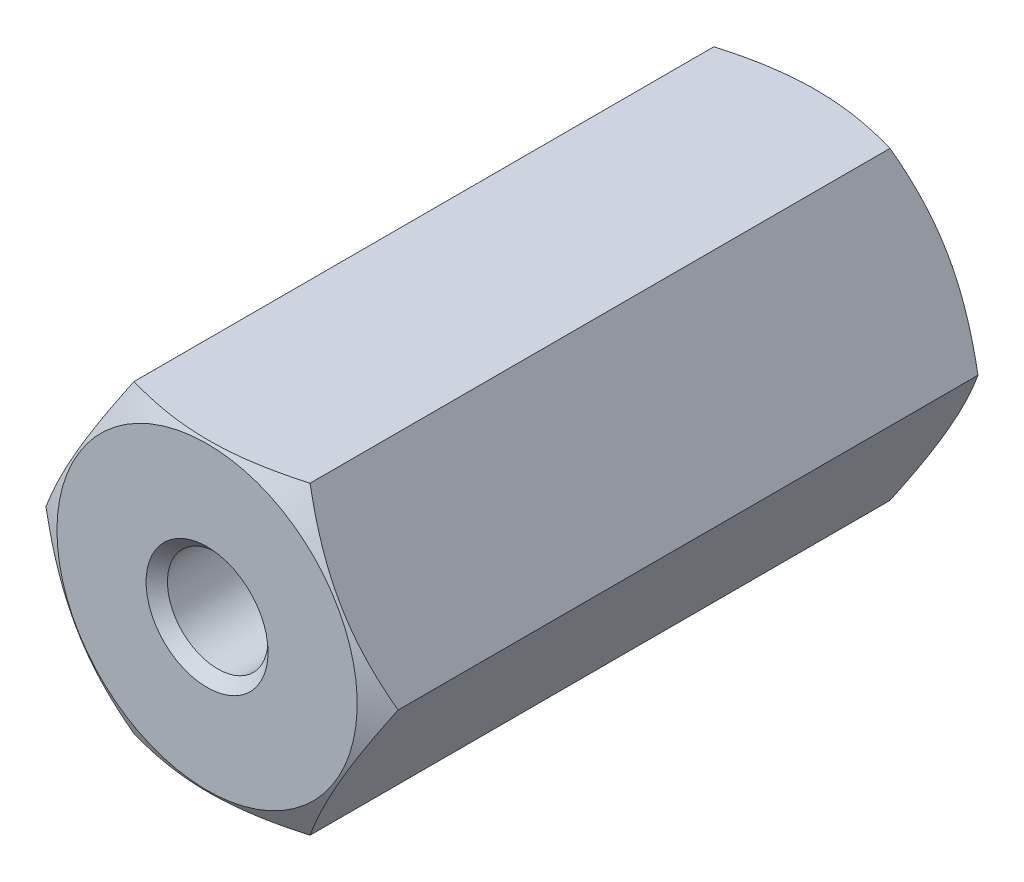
ISO-10303-21;
HEADER;
FILE_DESCRIPTION(('STEP AP214'),'2;1');
FILE_NAME('part.step','',(''),(''),'','','');
FILE_SCHEMA(('AUTOMOTIVE_DESIGN { 1 0 10303 214 1 1 1 1 }'));
ENDSEC;
DATA;
#1=APPLICATION_CONTEXT('core data for automotive mechanical design processes');
#2=APPLICATION_PROTOCOL_DEFINITION('international standard','automotive_design',2000,#1);
#3=PRODUCT_CONTEXT('',#1,'mechanical');
#4=PRODUCT('Part','Part','',(#3));
#5=PRODUCT_RELATED_PRODUCT_CATEGORY('part','',(#4));
#6=PRODUCT_DEFINITION_FORMATION('','',#4);
#7=PRODUCT_DEFINITION_CONTEXT('part definition',#1,'design');
#8=PRODUCT_DEFINITION('design','',#6,#7);
#9=PRODUCT_DEFINITION_SHAPE('','',#8);
#10=(LENGTH_UNIT() NAMED_UNIT(*) SI_UNIT(.MILLI.,.METRE.));
#11=(NAMED_UNIT(*) PLANE_ANGLE_UNIT() SI_UNIT($,.RADIAN.));
#12=(NAMED_UNIT(*) SI_UNIT($,.STERADIAN.) SOLID_ANGLE_UNIT());
#13=UNCERTAINTY_MEASURE_WITH_UNIT(LENGTH_MEASURE(1.E-05),#10,'distance_accuracy_value','');
#14=(GEOMETRIC_REPRESENTATION_CONTEXT(3) GLOBAL_UNCERTAINTY_ASSIGNED_CONTEXT((#13)) GLOBAL_UNIT_ASSIGNED_CONTEXT((#10,
#11,#12)) REPRESENTATION_CONTEXT('',''));
#15=CARTESIAN_POINT('',(0.,0.,0.));
#16=DIRECTION('',(0.,0.,1.));
#17=DIRECTION('',(1.,0.,0.));
#18=AXIS2_PLACEMENT_3D('',#15,#16,#17);
#19=CARTESIAN_POINT('',(-5.77350269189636,0.,1.11022302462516E-13));
#20=DIRECTION('',(0.,0.,1.));
#21=DIRECTION('',(1.,0.,0.));
#22=AXIS2_PLACEMENT_3D('',#19,#20,#21);
#23=PLANE('',#22);
#24=CARTESIAN_POINT('',(0.,0.,0.));
#25=DIRECTION('',(0.,0.,1.));
#26=DIRECTION('',(1.,0.,0.));
#27=AXIS2_PLACEMENT_3D('',#24,#25,#26);
#28=CIRCLE('',#27,2.);
#29=CARTESIAN_POINT('',(2.,0.,0.));
#30=VERTEX_POINT('',#29);
#31=EDGE_CURVE('E11',#30,#30,#28,.F.);
#32=ORIENTED_EDGE('',*,*,#31,.T.);
#33=EDGE_LOOP('',(#32));
#34=FACE_BOUND('',#33,.T.);
#35=CARTESIAN_POINT('',(0.,0.,0.));
#36=DIRECTION('',(0.,0.,-1.));
#37=DIRECTION('',(-1.,0.,0.));
#38=AXIS2_PLACEMENT_3D('',#35,#36,#37);
#39=CIRCLE('',#38,4.92350269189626);
#40=CARTESIAN_POINT('',(-4.92350269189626,0.,0.));
#41=VERTEX_POINT('',#40);
#42=EDGE_CURVE('E328',#41,#41,#39,.T.);
#43=ORIENTED_EDGE('',*,*,#42,.F.);
#44=EDGE_LOOP('',(#43));
#45=FACE_BOUND('',#44,.T.);
#46=ADVANCED_FACE('F32',(#34,#45),#23,.T.);
#47=CARTESIAN_POINT('',(0.,0.,-10.));
#48=DIRECTION('',(0.,0.,1.));
#49=DIRECTION('',(1.,0.,0.));
#50=AXIS2_PLACEMENT_3D('',#47,#48,#49);
#51=CONICAL_SURFACE('',#50,1.65,1.02974425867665);
#52=CARTESIAN_POINT('',(0.,0.,-10.9914200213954));
#53=VERTEX_POINT('',#52);
#54=VERTEX_LOOP('',#53);
#55=FACE_BOUND('',#54,.T.);
#56=CARTESIAN_POINT('',(0.,0.,-10.));
#57=DIRECTION('',(0.,0.,1.));
#58=DIRECTION('',(1.,0.,0.));
#59=AXIS2_PLACEMENT_3D('',#56,#57,#58);
#60=CIRCLE('',#59,1.65);
#61=CARTESIAN_POINT('',(1.65,0.,-10.));
#62=VERTEX_POINT('',#61);
#63=EDGE_CURVE('E123',#62,#62,#60,.T.);
#64=ORIENTED_EDGE('',*,*,#63,.T.);
#65=EDGE_LOOP('',(#64));
#66=FACE_BOUND('',#65,.T.);
#67=ADVANCED_FACE('F215',(#55,#66),#51,.F.);
#68=CARTESIAN_POINT('',(0.,0.,0.));
#69=DIRECTION('',(0.,0.,1.));
#70=DIRECTION('',(1.,0.,0.));
#71=AXIS2_PLACEMENT_3D('',#68,#69,#70);
#72=CYLINDRICAL_SURFACE('',#71,1.65);
#73=CARTESIAN_POINT('',(0.,0.,-0.349999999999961));
#74=DIRECTION('',(0.,0.,1.));
#75=DIRECTION('',(1.,0.,0.));
#76=AXIS2_PLACEMENT_3D('',#73,#74,#75);
#77=CIRCLE('',#76,1.65);
#78=CARTESIAN_POINT('',(1.65,0.,-0.349999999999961));
#79=VERTEX_POINT('',#78);
#80=EDGE_CURVE('E41',#79,#79,#77,.T.);
#81=ORIENTED_EDGE('',*,*,#80,.T.);
#82=EDGE_LOOP('',(#81));
#83=FACE_BOUND('',#82,.T.);
#84=ORIENTED_EDGE('',*,*,#63,.F.);
#85=EDGE_LOOP('',(#84));
#86=FACE_BOUND('',#85,.T.);
#87=ADVANCED_FACE('F218',(#83,#86),#72,.F.);
#88=CARTESIAN_POINT('',(0.,0.,-0.490747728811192));
#89=DIRECTION('',(0.,0.,-1.));
#90=DIRECTION('',(-1.,0.,0.));
#91=AXIS2_PLACEMENT_3D('',#88,#89,#90);
#92=CONICAL_SURFACE('',#91,5.77350269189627,1.04719755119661);
#93=ORIENTED_EDGE('',*,*,#42,.T.);
#94=EDGE_LOOP('',(#93));
#95=FACE_BOUND('',#94,.T.);
#96=CARTESIAN_POINT('',(-2.88663587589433,-5.00020000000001,-0.490814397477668));
#97=CARTESIAN_POINT('',(-3.01349970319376,-4.78046540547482,-0.417552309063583));
#98=CARTESIAN_POINT('',(-3.14144859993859,-4.55885141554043,-0.350917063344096));
#99=CARTESIAN_POINT('',(-3.39956193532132,-4.11178600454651,-0.234604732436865));
#100=CARTESIAN_POINT('',(-3.52973095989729,-3.88632664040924,-0.184968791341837));
#101=CARTESIAN_POINT('',(-3.78847564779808,-3.43816769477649,-0.107716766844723));
#102=CARTESIAN_POINT('',(-3.9170110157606,-3.2155379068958,-0.0795861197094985));
#103=CARTESIAN_POINT('',(-4.11026620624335,-2.88081009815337,-0.0543606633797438));
#104=CARTESIAN_POINT('',(-4.17472868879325,-2.76915780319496,-0.0487792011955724));
#105=CARTESIAN_POINT('',(-4.30371322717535,-2.54575002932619,-0.0433679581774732));
#106=CARTESIAN_POINT('',(-4.36823528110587,-2.43399455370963,-0.0435379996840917));
#107=CARTESIAN_POINT('',(-4.54500768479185,-2.12781576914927,-0.0519193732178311));
#108=CARTESIAN_POINT('',(-4.65719946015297,-1.93349391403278,-0.0659955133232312));
#109=CARTESIAN_POINT('',(-4.88083840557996,-1.54613989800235,-0.110630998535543));
#110=CARTESIAN_POINT('',(-4.99228478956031,-1.35310909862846,-0.141205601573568));
#111=CARTESIAN_POINT('',(-5.21637431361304,-0.964974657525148,-0.217634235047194));
#112=CARTESIAN_POINT('',(-5.32898917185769,-0.769920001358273,-0.263812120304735));
#113=CARTESIAN_POINT('',(-5.55253939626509,-0.382719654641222,-0.368617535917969));
#114=CARTESIAN_POINT('',(-5.663477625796,-0.190569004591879,-0.427220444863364));
#115=CARTESIAN_POINT('',(-5.7736181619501,0.000200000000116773,-0.490814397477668));
#116=B_SPLINE_CURVE_WITH_KNOTS('',3,(#96,#97,#98,#99,#100,#101,#102,#103,#104,#105,#106,#107,
#108,#109,#110,#111,#112,#113,#114,#115),.UNSPECIFIED.,.F.,.F.,(4,2,2,2,2,2,2,2,2,4),(0.,
0.792555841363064,1.58701660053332,2.3618153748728,2.74884076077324,3.13585419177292,
3.80962362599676,4.48401723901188,5.1733688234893,5.86136694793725),.UNSPECIFIED.);
#117=CARTESIAN_POINT('',(-2.88675134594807,-4.99999999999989,-0.490747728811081));
#118=VERTEX_POINT('',#117);
#119=CARTESIAN_POINT('',(-5.77350269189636,0.,-0.490747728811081));
#120=VERTEX_POINT('',#119);
#121=EDGE_CURVE('E184',#118,#120,#116,.T.);
#122=ORIENTED_EDGE('',*,*,#121,.F.);
#123=CARTESIAN_POINT('',(-7.64996583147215,-4.99999999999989,-2.43383923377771));
#124=CARTESIAN_POINT('',(-7.43048517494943,-4.99999999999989,-2.32779950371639));
#125=CARTESIAN_POINT('',(-7.21048489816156,-4.99999999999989,-2.22281577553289));
#126=CARTESIAN_POINT('',(-6.76916411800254,-4.99999999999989,-2.01556390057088));
#127=CARTESIAN_POINT('',(-6.54784339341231,-4.99999999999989,-1.91329622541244));
#128=CARTESIAN_POINT('',(-6.10240214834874,-4.99999999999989,-1.71153994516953));
#129=CARTESIAN_POINT('',(-5.87827284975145,-4.99999999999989,-1.61207065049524));
#130=CARTESIAN_POINT('',(-5.4281698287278,-4.99999999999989,-1.41741334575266));
#131=CARTESIAN_POINT('',(-5.20219620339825,-4.9999999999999,-1.32222511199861));
#132=CARTESIAN_POINT('',(-4.74526842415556,-4.99999999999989,-1.1361501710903));
#133=CARTESIAN_POINT('',(-4.51428711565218,-4.99999999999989,-1.04532977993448));
#134=CARTESIAN_POINT('',(-4.04959769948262,-4.9999999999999,-0.870817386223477));
#135=CARTESIAN_POINT('',(-3.8158892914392,-4.99999999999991,-0.787126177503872));
#136=CARTESIAN_POINT('',(-3.34585674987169,-4.99999999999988,-0.629125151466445));
#137=CARTESIAN_POINT('',(-3.10953940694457,-4.99999999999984,-0.554795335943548));
#138=CARTESIAN_POINT('',(-2.63354301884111,-4.99999999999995,-0.417935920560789));
#139=CARTESIAN_POINT('',(-2.39386506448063,-5.00000000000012,-0.355402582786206));
#140=CARTESIAN_POINT('',(-1.91099278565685,-5.00000000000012,-0.245172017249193));
#141=CARTESIAN_POINT('',(-1.66779746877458,-4.99999999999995,-0.197479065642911));
#142=CARTESIAN_POINT('',(-1.17844756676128,-4.99999999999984,-0.120157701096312));
#143=CARTESIAN_POINT('',(-0.93229297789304,-4.99999999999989,-0.0905293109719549));
#144=CARTESIAN_POINT('',(-0.562673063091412,-4.9999999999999,-0.0615346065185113));
#145=CARTESIAN_POINT('',(-0.439782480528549,-4.99999999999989,-0.0544426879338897));
#146=CARTESIAN_POINT('',(-0.193805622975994,-4.9999999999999,-0.0454655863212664));
#147=CARTESIAN_POINT('',(-0.070719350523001,-4.99999999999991,-0.0435803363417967));
#148=CARTESIAN_POINT('',(0.175385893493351,-4.99999999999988,-0.0450673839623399));
#149=CARTESIAN_POINT('',(0.298404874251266,-4.99999999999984,-0.0484382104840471));
#150=CARTESIAN_POINT('',(0.544194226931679,-4.99999999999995,-0.0603521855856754));
#151=CARTESIAN_POINT('',(0.66696458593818,-5.00000000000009,-0.0688955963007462));
#152=CARTESIAN_POINT('',(0.964731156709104,-5.00000000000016,-0.0957121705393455));
#153=CARTESIAN_POINT('',(1.13949668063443,-4.99999999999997,-0.11658889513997));
#154=CARTESIAN_POINT('',(1.48765996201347,-4.99999999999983,-0.16766063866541));
#155=CARTESIAN_POINT('',(1.66105753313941,-4.99999999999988,-0.197856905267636));
#156=CARTESIAN_POINT('',(2.0063771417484,-4.99999999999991,-0.266499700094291));
#157=CARTESIAN_POINT('',(2.17829752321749,-4.9999999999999,-0.304954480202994));
#158=CARTESIAN_POINT('',(2.52037325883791,-4.99999999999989,-0.388941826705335));
#159=CARTESIAN_POINT('',(2.69052871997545,-4.9999999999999,-0.434473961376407));
#160=CARTESIAN_POINT('',(3.03324831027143,-4.9999999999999,-0.532713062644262));
#161=CARTESIAN_POINT('',(3.20576967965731,-4.9999999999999,-0.585568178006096));
#162=CARTESIAN_POINT('',(3.54898873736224,-4.9999999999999,-0.696487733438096));
#163=CARTESIAN_POINT('',(3.71968759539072,-4.9999999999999,-0.75454857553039));
#164=CARTESIAN_POINT('',(4.05857655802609,-4.9999999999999,-0.874681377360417));
#165=CARTESIAN_POINT('',(4.22677537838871,-4.9999999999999,-0.936728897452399));
#166=CARTESIAN_POINT('',(4.56186914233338,-4.9999999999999,-1.06445734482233));
#167=CARTESIAN_POINT('',(4.72876352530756,-4.9999999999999,-1.13013974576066));
#168=CARTESIAN_POINT('',(4.89505217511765,-4.99999999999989,-1.1972797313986));
#169=B_SPLINE_CURVE_WITH_KNOTS('',3,(#123,#124,#125,#126,#127,#128,#129,#130,#131,#132,#133,
#134,#135,#136,#137,#138,#139,#140,#141,#142,#143,#144,#145,#146,#147,#148,#149,#150,#151,#152,
#153,#154,#155,#156,#157,#158,#159,#160,#161,#162,#163,#164,#165,#166,#167,#168),.UNSPECIFIED.,
.F.,.F.,(4,2,2,2,2,2,2,2,2,2,2,2,2,2,2,2,2,2,2,2,2,2,4),(0.,0.731272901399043,1.4626719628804,
2.19826723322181,2.93382402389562,3.67831788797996,4.42289454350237,5.16585260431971,
5.90857484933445,6.65151090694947,7.39444790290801,7.7636393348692,8.13282601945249,
8.50190939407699,8.87101147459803,9.39874138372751,9.92654197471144,10.4548724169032,
10.9831706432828,11.5243797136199,12.0652175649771,12.6030085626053,13.141019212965),.UNSPECIFIED.);
#170=CARTESIAN_POINT('',(2.88675134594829,-4.99999999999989,-0.490747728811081));
#171=VERTEX_POINT('',#170);
#172=EDGE_CURVE('E176',#171,#118,#169,.F.);
#173=ORIENTED_EDGE('',*,*,#172,.F.);
#174=CARTESIAN_POINT('',(2.88663587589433,-5.00020000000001,-0.490814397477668));
#175=CARTESIAN_POINT('',(3.01349970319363,-4.78046540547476,-0.41755230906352));
#176=CARTESIAN_POINT('',(3.14144859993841,-4.55885141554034,-0.350917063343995));
#177=CARTESIAN_POINT('',(3.3995619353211,-4.11178600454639,-0.234604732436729));
#178=CARTESIAN_POINT('',(3.52973095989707,-3.88632664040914,-0.184968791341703));
#179=CARTESIAN_POINT('',(3.78847564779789,-3.43816769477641,-0.107716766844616));
#180=CARTESIAN_POINT('',(3.91701101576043,-3.21553790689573,-0.0795861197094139));
#181=CARTESIAN_POINT('',(4.11026620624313,-2.88081009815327,-0.0543606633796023));
#182=CARTESIAN_POINT('',(4.17472868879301,-2.76915780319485,-0.0487792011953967));
#183=CARTESIAN_POINT('',(4.3037132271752,-2.54575002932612,-0.0433679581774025));
#184=CARTESIAN_POINT('',(4.36823528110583,-2.43399455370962,-0.0435379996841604));
#185=CARTESIAN_POINT('',(4.54500768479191,-2.1278157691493,-0.0519193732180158));
#186=CARTESIAN_POINT('',(4.65719946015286,-1.93349391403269,-0.065995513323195));
#187=CARTESIAN_POINT('',(4.88083840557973,-1.54613989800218,-0.110630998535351));
#188=CARTESIAN_POINT('',(4.99228478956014,-1.35310909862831,-0.141205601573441));
#189=CARTESIAN_POINT('',(5.2163743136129,-0.964974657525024,-0.217634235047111));
#190=CARTESIAN_POINT('',(5.32898917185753,-0.769920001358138,-0.263812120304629));
#191=CARTESIAN_POINT('',(5.55253939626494,-0.382719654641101,-0.368617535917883));
#192=CARTESIAN_POINT('',(5.66347762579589,-0.190569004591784,-0.427220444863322));
#193=CARTESIAN_POINT('',(5.7736181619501,0.000200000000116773,-0.490814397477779));
#194=B_SPLINE_CURVE_WITH_KNOTS('',3,(#174,#175,#176,#177,#178,#179,#180,#181,#182,#183,#184,
#185,#186,#187,#188,#189,#190,#191,#192,#193),.UNSPECIFIED.,.F.,.F.,(4,2,2,2,2,2,2,2,2,4),(0.,
0.79255584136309,1.58701660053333,2.3618153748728,2.74884076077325,3.13585419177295,
3.80962362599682,4.48401723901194,5.17336882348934,5.86136694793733),.UNSPECIFIED.);
#195=CARTESIAN_POINT('',(5.77350269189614,0.,-0.490747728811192));
#196=VERTEX_POINT('',#195);
#197=EDGE_CURVE('E183',#171,#196,#194,.T.);
#198=ORIENTED_EDGE('',*,*,#197,.T.);
#199=CARTESIAN_POINT('',(5.7736181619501,-0.000200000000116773,-0.490814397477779));
#200=CARTESIAN_POINT('',(5.64675433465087,0.219534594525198,-0.417552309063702));
#201=CARTESIAN_POINT('',(5.51880543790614,0.441148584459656,-0.350917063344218));
#202=CARTESIAN_POINT('',(5.26069210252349,0.888213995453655,-0.234604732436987));
#203=CARTESIAN_POINT('',(5.1305230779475,1.11367335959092,-0.184968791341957));
#204=CARTESIAN_POINT('',(4.87177839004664,1.56183230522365,-0.107716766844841));
#205=CARTESIAN_POINT('',(4.74324302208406,1.78446209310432,-0.0795861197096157));
#206=CARTESIAN_POINT('',(4.54998783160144,2.11918990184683,-0.0543606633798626));
#207=CARTESIAN_POINT('',(4.48552534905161,2.23084219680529,-0.0487792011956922));
#208=CARTESIAN_POINT('',(4.35654081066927,2.45424997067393,-0.0433679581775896));
#209=CARTESIAN_POINT('',(4.29201875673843,2.56600544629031,-0.0435379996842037));
#210=CARTESIAN_POINT('',(4.1152463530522,2.87218423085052,-0.0519193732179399));
#211=CARTESIAN_POINT('',(4.00305457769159,3.06650608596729,-0.0659955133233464));
#212=CARTESIAN_POINT('',(3.77941563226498,3.45386010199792,-0.11063099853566));
#213=CARTESIAN_POINT('',(3.66796924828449,3.64689090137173,-0.141205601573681));
#214=CARTESIAN_POINT('',(3.44387972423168,4.03502534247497,-0.217634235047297));
#215=CARTESIAN_POINT('',(3.33126486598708,4.23007999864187,-0.263812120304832));
#216=CARTESIAN_POINT('',(3.10771464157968,4.61728034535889,-0.368617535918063));
#217=CARTESIAN_POINT('',(2.9967764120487,4.80943099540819,-0.427220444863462));
#218=CARTESIAN_POINT('',(2.88663587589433,5.00020000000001,-0.490814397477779));
#219=B_SPLINE_CURVE_WITH_KNOTS('',3,(#199,#200,#201,#202,#203,#204,#205,#206,#207,#208,#209,
#210,#211,#212,#213,#214,#215,#216,#217,#218),.UNSPECIFIED.,.F.,.F.,(4,2,2,2,2,2,2,2,2,4),(0.,
0.792555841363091,1.58701660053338,2.36181537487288,2.74884076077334,3.13585419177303,
3.80962362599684,4.48401723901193,5.17336882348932,5.86136694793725),.UNSPECIFIED.);
#220=CARTESIAN_POINT('',(2.88675134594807,5.00000000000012,-0.490747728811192));
#221=VERTEX_POINT('',#220);
#222=EDGE_CURVE('E112',#196,#221,#219,.T.);
#223=ORIENTED_EDGE('',*,*,#222,.T.);
#224=CARTESIAN_POINT('',(-7.64996583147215,4.99999999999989,-2.43383923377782));
#225=CARTESIAN_POINT('',(-7.43048517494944,5.00000000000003,-2.32779950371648));
#226=CARTESIAN_POINT('',(-7.21048489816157,5.00000000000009,-2.22281577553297));
#227=CARTESIAN_POINT('',(-6.76916411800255,5.00000000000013,-2.01556390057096));
#228=CARTESIAN_POINT('',(-6.54784339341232,5.00000000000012,-1.91329622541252));
#229=CARTESIAN_POINT('',(-6.10240214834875,5.00000000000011,-1.71153994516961));
#230=CARTESIAN_POINT('',(-5.87827284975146,5.00000000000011,-1.61207065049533));
#231=CARTESIAN_POINT('',(-5.4281698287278,5.00000000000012,-1.41741334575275));
#232=CARTESIAN_POINT('',(-5.20219620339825,5.00000000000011,-1.3222251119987));
#233=CARTESIAN_POINT('',(-4.74526842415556,5.00000000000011,-1.1361501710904));
#234=CARTESIAN_POINT('',(-4.51428711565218,5.00000000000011,-1.04532977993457));
#235=CARTESIAN_POINT('',(-4.04959769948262,5.00000000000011,-0.870817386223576));
#236=CARTESIAN_POINT('',(-3.8158892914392,5.00000000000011,-0.787126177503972));
#237=CARTESIAN_POINT('',(-3.34585674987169,5.00000000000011,-0.629125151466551));
#238=CARTESIAN_POINT('',(-3.10953940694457,5.00000000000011,-0.554795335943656));
#239=CARTESIAN_POINT('',(-2.6335430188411,5.00000000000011,-0.417935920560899));
#240=CARTESIAN_POINT('',(-2.39386506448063,5.00000000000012,-0.355402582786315));
#241=CARTESIAN_POINT('',(-1.91099278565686,5.00000000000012,-0.245172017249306));
#242=CARTESIAN_POINT('',(-1.66779746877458,5.00000000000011,-0.19747906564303));
#243=CARTESIAN_POINT('',(-1.17844756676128,5.00000000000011,-0.120157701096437));
#244=CARTESIAN_POINT('',(-0.932292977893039,5.00000000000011,-0.0905293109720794));
#245=CARTESIAN_POINT('',(-0.562673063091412,5.00000000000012,-0.0615346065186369));
#246=CARTESIAN_POINT('',(-0.439782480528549,5.00000000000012,-0.0544426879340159));
#247=CARTESIAN_POINT('',(-0.193805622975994,5.00000000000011,-0.0454655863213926));
#248=CARTESIAN_POINT('',(-0.0707193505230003,5.0000000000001,-0.0435803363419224));
#249=CARTESIAN_POINT('',(0.175385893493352,5.00000000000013,-0.0450673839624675));
#250=CARTESIAN_POINT('',(0.298404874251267,5.00000000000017,-0.048438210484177));
#251=CARTESIAN_POINT('',(0.54419422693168,5.00000000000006,-0.0603521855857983));
#252=CARTESIAN_POINT('',(0.66696458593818,4.99999999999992,-0.0688955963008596));
#253=CARTESIAN_POINT('',(0.964731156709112,4.99999999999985,-0.0957121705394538));
#254=CARTESIAN_POINT('',(1.13949668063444,5.00000000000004,-0.116588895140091));
#255=CARTESIAN_POINT('',(1.4876599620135,5.00000000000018,-0.16766063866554));
#256=CARTESIAN_POINT('',(1.66105753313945,5.00000000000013,-0.197856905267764));
#257=CARTESIAN_POINT('',(2.00637714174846,5.0000000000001,-0.26649970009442));
#258=CARTESIAN_POINT('',(2.17829752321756,5.00000000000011,-0.304954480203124));
#259=CARTESIAN_POINT('',(2.520373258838,5.00000000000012,-0.38894182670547));
#260=CARTESIAN_POINT('',(2.69052871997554,5.00000000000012,-0.434473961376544));
#261=CARTESIAN_POINT('',(3.03324831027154,5.00000000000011,-0.532713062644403));
#262=CARTESIAN_POINT('',(3.20576967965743,5.00000000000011,-0.58556817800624));
#263=CARTESIAN_POINT('',(3.54898873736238,5.00000000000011,-0.696487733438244));
#264=CARTESIAN_POINT('',(3.71968759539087,5.00000000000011,-0.75454857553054));
#265=CARTESIAN_POINT('',(4.05857655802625,5.00000000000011,-0.874681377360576));
#266=CARTESIAN_POINT('',(4.22677537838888,5.00000000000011,-0.936728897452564));
#267=CARTESIAN_POINT('',(4.56186914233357,5.00000000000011,-1.06445734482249));
#268=CARTESIAN_POINT('',(4.72876352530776,5.00000000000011,-1.13013974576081));
#269=CARTESIAN_POINT('',(4.89505217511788,5.00000000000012,-1.19727973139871));
#270=B_SPLINE_CURVE_WITH_KNOTS('',3,(#224,#225,#226,#227,#228,#229,#230,#231,#232,#233,#234,
#235,#236,#237,#238,#239,#240,#241,#242,#243,#244,#245,#246,#247,#248,#249,#250,#251,#252,#253,
#254,#255,#256,#257,#258,#259,#260,#261,#262,#263,#264,#265,#266,#267,#268,#269),.UNSPECIFIED.,
.F.,.F.,(4,2,2,2,2,2,2,2,2,2,2,2,2,2,2,2,2,2,2,2,2,2,4),(0.,0.731272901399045,1.46267196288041,
2.19826723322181,2.93382402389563,3.67831788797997,4.42289454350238,5.16585260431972,
5.90857484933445,6.65151090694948,7.39444790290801,7.7636393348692,8.13282601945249,
8.50190939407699,8.87101147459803,9.39874138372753,9.9265419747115,10.4548724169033,
10.9831706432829,11.52437971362,12.0652175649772,12.6030085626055,13.1410192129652),.UNSPECIFIED.);
#271=CARTESIAN_POINT('',(-2.88675134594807,5.00000000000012,-0.490747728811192));
#272=VERTEX_POINT('',#271);
#273=EDGE_CURVE('E196',#221,#272,#270,.F.);
#274=ORIENTED_EDGE('',*,*,#273,.T.);
#275=CARTESIAN_POINT('',(-5.7736181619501,-0.000199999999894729,-0.490814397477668));
#276=CARTESIAN_POINT('',(-5.64675433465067,0.219534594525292,-0.417552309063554));
#277=CARTESIAN_POINT('',(-5.51880543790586,0.441148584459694,-0.350917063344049));
#278=CARTESIAN_POINT('',(-5.26069210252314,0.888213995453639,-0.2346047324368));
#279=CARTESIAN_POINT('',(-5.13052307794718,1.11367335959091,-0.184968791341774));
#280=CARTESIAN_POINT('',(-4.87177839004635,1.56183230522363,-0.10771676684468));
#281=CARTESIAN_POINT('',(-4.74324302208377,1.7844620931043,-0.0795861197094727));
#282=CARTESIAN_POINT('',(-4.54998783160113,2.11918990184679,-0.054360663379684));
#283=CARTESIAN_POINT('',(-4.48552534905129,2.23084219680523,-0.0487792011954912));
#284=CARTESIAN_POINT('',(-4.35654081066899,2.45424997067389,-0.043367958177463));
#285=CARTESIAN_POINT('',(-4.2920187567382,2.5660054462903,-0.0435379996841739));
#286=CARTESIAN_POINT('',(-4.115246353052,2.87218423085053,-0.0519193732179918));
#287=CARTESIAN_POINT('',(-4.00305457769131,3.06650608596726,-0.0659955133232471));
#288=CARTESIAN_POINT('',(-3.77941563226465,3.45386010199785,-0.110630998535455));
#289=CARTESIAN_POINT('',(-3.66796924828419,3.64689090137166,-0.14120560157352));
#290=CARTESIAN_POINT('',(-3.44387972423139,4.03502534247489,-0.217634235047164));
#291=CARTESIAN_POINT('',(-3.33126486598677,4.23007999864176,-0.263812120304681));
#292=CARTESIAN_POINT('',(-3.10771464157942,4.61728034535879,-0.368617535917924));
#293=CARTESIAN_POINT('',(-2.99677641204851,4.80943099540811,-0.427220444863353));
#294=CARTESIAN_POINT('',(-2.88663587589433,5.00020000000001,-0.490814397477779));
#295=B_SPLINE_CURVE_WITH_KNOTS('',3,(#275,#276,#277,#278,#279,#280,#281,#282,#283,#284,#285,
#286,#287,#288,#289,#290,#291,#292,#293,#294),.UNSPECIFIED.,.F.,.F.,(4,2,2,2,2,2,2,2,2,4),(0.,
0.792555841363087,1.58701660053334,2.36181537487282,2.74884076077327,3.13585419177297,
3.80962362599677,4.48401723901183,5.17336882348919,5.86136694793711),.UNSPECIFIED.);
#296=EDGE_CURVE('E232',#120,#272,#295,.T.);
#297=ORIENTED_EDGE('',*,*,#296,.F.);
#298=EDGE_LOOP('',(#122,#173,#198,#223,#274,#297));
#299=FACE_BOUND('',#298,.T.);
#300=ADVANCED_FACE('F135',(#95,#299),#92,.T.);
#301=CARTESIAN_POINT('',(-5.77350269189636,0.,-19.9999999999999));
#302=DIRECTION('',(-0.86602540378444,-0.499999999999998,0.));
#303=DIRECTION('',(0.499999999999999,-0.86602540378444,0.));
#304=AXIS2_PLACEMENT_3D('',#301,#302,#303);
#305=PLANE('',#304);
#306=CARTESIAN_POINT('',(-2.88663587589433,-5.00019999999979,-19.5091856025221));
#307=CARTESIAN_POINT('',(-3.01349970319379,-4.78046540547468,-19.5824476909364));
#308=CARTESIAN_POINT('',(-3.14144859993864,-4.55885141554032,-19.6490829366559));
#309=CARTESIAN_POINT('',(-3.39956193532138,-4.11178600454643,-19.7653952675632));
#310=CARTESIAN_POINT('',(-3.52973095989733,-3.88632664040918,-19.8150312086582));
#311=CARTESIAN_POINT('',(-3.7884756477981,-3.43816769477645,-19.8922832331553));
#312=CARTESIAN_POINT('',(-3.91701101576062,-3.21553790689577,-19.9204138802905));
#313=CARTESIAN_POINT('',(-4.11026620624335,-2.88081009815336,-19.9456393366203));
#314=CARTESIAN_POINT('',(-4.17472868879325,-2.76915780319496,-19.9512207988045));
#315=CARTESIAN_POINT('',(-4.30371322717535,-2.54575002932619,-19.9566320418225));
#316=CARTESIAN_POINT('',(-4.36823528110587,-2.43399455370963,-19.9564620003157));
#317=CARTESIAN_POINT('',(-4.54500768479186,-2.12781576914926,-19.9480806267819));
#318=CARTESIAN_POINT('',(-4.65719946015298,-1.93349391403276,-19.9340044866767));
#319=CARTESIAN_POINT('',(-4.88083840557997,-1.54613989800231,-19.8893690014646));
#320=CARTESIAN_POINT('',(-4.99228478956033,-1.35310909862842,-19.8587943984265));
#321=CARTESIAN_POINT('',(-5.21637431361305,-0.964974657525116,-19.7823657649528));
#322=CARTESIAN_POINT('',(-5.32898917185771,-0.76992000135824,-19.7361878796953));
#323=CARTESIAN_POINT('',(-5.5525393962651,-0.382719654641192,-19.631382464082));
#324=CARTESIAN_POINT('',(-5.66347762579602,-0.190569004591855,-19.5727795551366));
#325=CARTESIAN_POINT('',(-5.7736181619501,0.000200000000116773,-19.5091856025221));
#326=B_SPLINE_CURVE_WITH_KNOTS('',3,(#306,#307,#308,#309,#310,#311,#312,#313,#314,#315,#316,
#317,#318,#319,#320,#321,#322,#323,#324,#325),.UNSPECIFIED.,.F.,.F.,(4,2,2,2,2,2,2,2,2,4),(0.,
0.792555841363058,1.58701660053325,2.36181537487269,2.74884076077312,3.1358541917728,
3.80962362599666,4.48401723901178,5.17336882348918,5.86136694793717),.UNSPECIFIED.);
#327=CARTESIAN_POINT('',(-2.88675134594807,-4.99999999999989,-19.5092522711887));
#328=VERTEX_POINT('',#327);
#329=CARTESIAN_POINT('',(-5.77350269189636,0.,-19.5092522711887));
#330=VERTEX_POINT('',#329);
#331=EDGE_CURVE('E48',#328,#330,#326,.T.);
#332=ORIENTED_EDGE('',*,*,#331,.F.);
#333=DIRECTION('',(0.,0.,1.));
#334=VECTOR('',#333,1.);
#335=CARTESIAN_POINT('',(-2.88675134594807,-4.99999999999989,-19.9999999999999));
#336=LINE('',#335,#334);
#337=EDGE_CURVE('E117',#328,#118,#336,.T.);
#338=ORIENTED_EDGE('',*,*,#337,.T.);
#339=ORIENTED_EDGE('',*,*,#121,.T.);
#340=DIRECTION('',(0.,0.,1.));
#341=VECTOR('',#340,1.);
#342=CARTESIAN_POINT('',(-5.77350269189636,0.,-19.9999999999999));
#343=LINE('',#342,#341);
#344=EDGE_CURVE('E55',#330,#120,#343,.T.);
#345=ORIENTED_EDGE('',*,*,#344,.F.);
#346=EDGE_LOOP('',(#332,#338,#339,#345));
#347=FACE_BOUND('',#346,.T.);
#348=ADVANCED_FACE('F170',(#347),#305,.T.);
#349=CARTESIAN_POINT('',(-2.88675134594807,-4.99999999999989,-19.9999999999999));
#350=DIRECTION('',(0.,-1.,0.));
#351=DIRECTION('',(1.,0.,0.));
#352=AXIS2_PLACEMENT_3D('',#349,#350,#351);
#353=PLANE('',#352);
#354=CARTESIAN_POINT('',(-7.64996583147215,-4.99999999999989,-17.566160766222));
#355=CARTESIAN_POINT('',(-7.4304851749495,-4.99999999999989,-17.6722004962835));
#356=CARTESIAN_POINT('',(-7.21048489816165,-4.99999999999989,-17.7771842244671));
#357=CARTESIAN_POINT('',(-6.76916411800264,-4.99999999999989,-17.9844360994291));
#358=CARTESIAN_POINT('',(-6.5478433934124,-4.99999999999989,-18.0867037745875));
#359=CARTESIAN_POINT('',(-6.10240214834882,-4.99999999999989,-18.2884600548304));
#360=CARTESIAN_POINT('',(-5.87827284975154,-4.99999999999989,-18.3879293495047));
#361=CARTESIAN_POINT('',(-5.42816982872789,-4.99999999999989,-18.5825866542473));
#362=CARTESIAN_POINT('',(-5.20219620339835,-4.99999999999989,-18.6777748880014));
#363=CARTESIAN_POINT('',(-4.74526842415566,-4.99999999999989,-18.8638498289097));
#364=CARTESIAN_POINT('',(-4.51428711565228,-4.99999999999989,-18.9546702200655));
#365=CARTESIAN_POINT('',(-4.04959769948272,-4.9999999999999,-19.1291826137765));
#366=CARTESIAN_POINT('',(-3.8158892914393,-4.99999999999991,-19.2128738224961));
#367=CARTESIAN_POINT('',(-3.3458567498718,-4.99999999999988,-19.3708748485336));
#368=CARTESIAN_POINT('',(-3.10953940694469,-4.99999999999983,-19.4452046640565));
#369=CARTESIAN_POINT('',(-2.63354301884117,-4.99999999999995,-19.5820640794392));
#370=CARTESIAN_POINT('',(-2.39386506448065,-5.00000000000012,-19.6445974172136));
#371=CARTESIAN_POINT('',(-1.91099278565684,-5.00000000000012,-19.7548279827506));
#372=CARTESIAN_POINT('',(-1.6677974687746,-4.99999999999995,-19.8025209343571));
#373=CARTESIAN_POINT('',(-1.17844756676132,-4.99999999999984,-19.8798422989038));
#374=CARTESIAN_POINT('',(-0.932292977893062,-4.99999999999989,-19.9094706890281));
#375=CARTESIAN_POINT('',(-0.562673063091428,-4.9999999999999,-19.9384653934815));
#376=CARTESIAN_POINT('',(-0.439782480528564,-4.99999999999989,-19.9455573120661));
#377=CARTESIAN_POINT('',(-0.193805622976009,-4.9999999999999,-19.9545344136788));
#378=CARTESIAN_POINT('',(-0.0707193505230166,-4.99999999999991,-19.9564196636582));
#379=CARTESIAN_POINT('',(0.175385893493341,-4.99999999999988,-19.9549326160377));
#380=CARTESIAN_POINT('',(0.298404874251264,-4.99999999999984,-19.951561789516));
#381=CARTESIAN_POINT('',(0.544194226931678,-4.99999999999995,-19.9396478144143));
#382=CARTESIAN_POINT('',(0.666964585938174,-5.00000000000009,-19.9311044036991));
#383=CARTESIAN_POINT('',(0.964731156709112,-5.00000000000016,-19.9042878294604));
#384=CARTESIAN_POINT('',(1.13949668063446,-4.99999999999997,-19.88341110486));
#385=CARTESIAN_POINT('',(1.48765996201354,-4.99999999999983,-19.8323393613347));
#386=CARTESIAN_POINT('',(1.66105753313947,-4.99999999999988,-19.8021430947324));
#387=CARTESIAN_POINT('',(2.00637714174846,-4.99999999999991,-19.7335002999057));
#388=CARTESIAN_POINT('',(2.17829752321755,-4.9999999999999,-19.695045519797));
#389=CARTESIAN_POINT('',(2.52037325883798,-4.99999999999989,-19.6110581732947));
#390=CARTESIAN_POINT('',(2.69052871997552,-4.99999999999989,-19.5655260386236));
#391=CARTESIAN_POINT('',(3.03324831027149,-4.9999999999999,-19.4672869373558));
#392=CARTESIAN_POINT('',(3.20576967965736,-4.9999999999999,-19.4144318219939));
#393=CARTESIAN_POINT('',(3.54898873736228,-4.9999999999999,-19.3035122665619));
#394=CARTESIAN_POINT('',(3.71968759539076,-4.9999999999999,-19.2454514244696));
#395=CARTESIAN_POINT('',(4.05857655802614,-4.9999999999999,-19.1253186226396));
#396=CARTESIAN_POINT('',(4.22677537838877,-4.9999999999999,-19.0632711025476));
#397=CARTESIAN_POINT('',(4.56186914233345,-4.9999999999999,-18.9355426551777));
#398=CARTESIAN_POINT('',(4.7287635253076,-4.9999999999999,-18.8698602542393));
#399=CARTESIAN_POINT('',(4.89505217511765,-4.99999999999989,-18.8027202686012));
#400=B_SPLINE_CURVE_WITH_KNOTS('',3,(#354,#355,#356,#357,#358,#359,#360,#361,#362,#363,#364,
#365,#366,#367,#368,#369,#370,#371,#372,#373,#374,#375,#376,#377,#378,#379,#380,#381,#382,#383,
#384,#385,#386,#387,#388,#389,#390,#391,#392,#393,#394,#395,#396,#397,#398,#399),.UNSPECIFIED.,
.F.,.F.,(4,2,2,2,2,2,2,2,2,2,2,2,2,2,2,2,2,2,2,2,2,2,4),(0.,0.731272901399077,1.46267196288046,
2.19826723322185,2.93382402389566,3.67831788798,4.4228945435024,5.16585260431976,
5.90857484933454,6.65151090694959,7.39444790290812,7.76363933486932,8.13282601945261,
8.50190939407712,8.87101147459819,9.39874138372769,9.92654197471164,10.4548724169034,
10.983170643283,11.5243797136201,12.0652175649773,12.6030085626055,13.1410192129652),.UNSPECIFIED.);
#401=CARTESIAN_POINT('',(2.88675134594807,-4.99999999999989,-19.5092522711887));
#402=VERTEX_POINT('',#401);
#403=EDGE_CURVE('E107',#402,#328,#400,.F.);
#404=ORIENTED_EDGE('',*,*,#403,.F.);
#405=DIRECTION('',(0.,0.,1.));
#406=VECTOR('',#405,1.);
#407=CARTESIAN_POINT('',(2.88675134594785,-4.99999999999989,-19.9999999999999));
#408=LINE('',#407,#406);
#409=EDGE_CURVE('E106',#402,#171,#408,.T.);
#410=ORIENTED_EDGE('',*,*,#409,.T.);
#411=ORIENTED_EDGE('',*,*,#172,.T.);
#412=ORIENTED_EDGE('',*,*,#337,.F.);
#413=EDGE_LOOP('',(#404,#410,#411,#412));
#414=FACE_BOUND('',#413,.T.);
#415=ADVANCED_FACE('F167',(#414),#353,.T.);
#416=CARTESIAN_POINT('',(5.77350269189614,0.,-20.));
#417=DIRECTION('',(-0.866025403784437,0.500000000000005,0.));
#418=DIRECTION('',(-0.500000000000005,-0.866025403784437,0.));
#419=AXIS2_PLACEMENT_3D('',#416,#417,#418);
#420=PLANE('',#419);
#421=ORIENTED_EDGE('',*,*,#409,.F.);
#422=CARTESIAN_POINT('',(2.88663587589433,-5.00020000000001,-19.5091856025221));
#423=CARTESIAN_POINT('',(3.01349970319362,-4.78046540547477,-19.5824476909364));
#424=CARTESIAN_POINT('',(3.1414485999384,-4.55885141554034,-19.649082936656));
#425=CARTESIAN_POINT('',(3.39956193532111,-4.11178600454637,-19.7653952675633));
#426=CARTESIAN_POINT('',(3.52973095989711,-3.88632664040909,-19.8150312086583));
#427=CARTESIAN_POINT('',(3.78847564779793,-3.43816769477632,-19.8922832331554));
#428=CARTESIAN_POINT('',(3.91701101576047,-3.21553790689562,-19.9204138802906));
#429=CARTESIAN_POINT('',(4.11026620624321,-2.88081009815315,-19.9456393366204));
#430=CARTESIAN_POINT('',(4.17472868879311,-2.76915780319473,-19.9512207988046));
#431=CARTESIAN_POINT('',(4.30371322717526,-2.54575002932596,-19.9566320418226));
#432=CARTESIAN_POINT('',(4.36823528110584,-2.43399455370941,-19.9564620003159));
#433=CARTESIAN_POINT('',(4.54500768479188,-2.12781576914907,-19.948080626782));
#434=CARTESIAN_POINT('',(4.65719946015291,-1.93349391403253,-19.9340044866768));
#435=CARTESIAN_POINT('',(4.88083840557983,-1.54613989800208,-19.8893690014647));
#436=CARTESIAN_POINT('',(4.9922847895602,-1.35310909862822,-19.8587943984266));
#437=CARTESIAN_POINT('',(5.21637431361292,-0.964974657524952,-19.7823657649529));
#438=CARTESIAN_POINT('',(5.32898917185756,-0.769920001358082,-19.7361878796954));
#439=CARTESIAN_POINT('',(5.55253939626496,-0.382719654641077,-19.6313824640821));
#440=CARTESIAN_POINT('',(5.66347762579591,-0.190569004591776,-19.5727795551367));
#441=CARTESIAN_POINT('',(5.7736181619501,0.000200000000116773,-19.5091856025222));
#442=B_SPLINE_CURVE_WITH_KNOTS('',3,(#422,#423,#424,#425,#426,#427,#428,#429,#430,#431,#432,
#433,#434,#435,#436,#437,#438,#439,#440,#441),.UNSPECIFIED.,.F.,.F.,(4,2,2,2,2,2,2,2,2,4),(0.,
0.792555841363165,1.58701660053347,2.361815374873,2.74884076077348,3.13585419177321,
3.80962362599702,4.48401723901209,5.17336882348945,5.86136694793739),.UNSPECIFIED.);
#443=CARTESIAN_POINT('',(5.77350269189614,0.,-19.5092522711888));
#444=VERTEX_POINT('',#443);
#445=EDGE_CURVE('E92',#402,#444,#442,.T.);
#446=ORIENTED_EDGE('',*,*,#445,.T.);
#447=DIRECTION('',(0.,0.,1.));
#448=VECTOR('',#447,1.);
#449=CARTESIAN_POINT('',(5.77350269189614,0.,-20.));
#450=LINE('',#449,#448);
#451=EDGE_CURVE('E104',#444,#196,#450,.T.);
#452=ORIENTED_EDGE('',*,*,#451,.T.);
#453=ORIENTED_EDGE('',*,*,#197,.F.);
#454=EDGE_LOOP('',(#421,#446,#452,#453));
#455=FACE_BOUND('',#454,.T.);
#456=ADVANCED_FACE('F102',(#455),#420,.F.);
#457=CARTESIAN_POINT('',(2.88675134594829,5.00000000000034,-20.));
#458=DIRECTION('',(-0.86602540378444,-0.499999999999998,0.));
#459=DIRECTION('',(0.499999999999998,-0.86602540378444,0.));
#460=AXIS2_PLACEMENT_3D('',#457,#458,#459);
#461=PLANE('',#460);
#462=ORIENTED_EDGE('',*,*,#451,.F.);
#463=CARTESIAN_POINT('',(5.7736181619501,-0.000200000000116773,-19.5091856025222));
#464=CARTESIAN_POINT('',(5.64675433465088,0.219534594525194,-19.5824476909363));
#465=CARTESIAN_POINT('',(5.51880543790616,0.441148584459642,-19.6490829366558));
#466=CARTESIAN_POINT('',(5.2606921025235,0.88821399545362,-19.765395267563));
#467=CARTESIAN_POINT('',(5.13052307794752,1.11367335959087,-19.8150312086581));
#468=CARTESIAN_POINT('',(4.87177839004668,1.56183230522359,-19.8922832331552));
#469=CARTESIAN_POINT('',(4.74324302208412,1.78446209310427,-19.9204138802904));
#470=CARTESIAN_POINT('',(4.54998783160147,2.11918990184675,-19.9456393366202));
#471=CARTESIAN_POINT('',(4.48552534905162,2.23084219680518,-19.9512207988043));
#472=CARTESIAN_POINT('',(4.35654081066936,2.45424997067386,-19.9566320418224));
#473=CARTESIAN_POINT('',(4.29201875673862,2.5660054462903,-19.9564620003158));
#474=CARTESIAN_POINT('',(4.11524635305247,2.87218423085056,-19.9480806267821));
#475=CARTESIAN_POINT('',(4.00305457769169,3.06650608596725,-19.9340044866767));
#476=CARTESIAN_POINT('',(3.77941563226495,3.45386010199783,-19.8893690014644));
#477=CARTESIAN_POINT('',(3.6679692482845,3.64689090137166,-19.8587943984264));
#478=CARTESIAN_POINT('',(3.44387972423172,4.03502534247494,-19.7823657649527));
#479=CARTESIAN_POINT('',(3.33126486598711,4.23007999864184,-19.7361878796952));
#480=CARTESIAN_POINT('',(3.10771464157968,4.61728034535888,-19.631382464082));
#481=CARTESIAN_POINT('',(2.99677641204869,4.80943099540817,-19.5727795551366));
#482=CARTESIAN_POINT('',(2.88663587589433,5.00020000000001,-19.5091856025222));
#483=B_SPLINE_CURVE_WITH_KNOTS('',3,(#463,#464,#465,#466,#467,#468,#469,#470,#471,#472,#473,
#474,#475,#476,#477,#478,#479,#480,#481,#482),.UNSPECIFIED.,.F.,.F.,(4,2,2,2,2,2,2,2,2,4),(0.,
0.792555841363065,1.58701660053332,2.3618153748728,2.74884076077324,3.13585419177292,
3.80962362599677,4.48401723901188,5.1733688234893,5.86136694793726),.UNSPECIFIED.);
#484=CARTESIAN_POINT('',(2.88675134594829,5.00000000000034,-19.5092522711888));
#485=VERTEX_POINT('',#484);
#486=EDGE_CURVE('E88',#444,#485,#483,.T.);
#487=ORIENTED_EDGE('',*,*,#486,.T.);
#488=DIRECTION('',(0.,0.,1.));
#489=VECTOR('',#488,1.);
#490=CARTESIAN_POINT('',(2.88675134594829,5.00000000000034,-20.));
#491=LINE('',#490,#489);
#492=EDGE_CURVE('E113',#485,#221,#491,.T.);
#493=ORIENTED_EDGE('',*,*,#492,.T.);
#494=ORIENTED_EDGE('',*,*,#222,.F.);
#495=EDGE_LOOP('',(#462,#487,#493,#494));
#496=FACE_BOUND('',#495,.T.);
#497=ADVANCED_FACE('F110',(#496),#461,.F.);
#498=CARTESIAN_POINT('',(-2.88675134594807,5.00000000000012,-20.));
#499=DIRECTION('',(0.,-1.,0.));
#500=DIRECTION('',(0.,0.,-1.));
#501=AXIS2_PLACEMENT_3D('',#498,#499,#500);
#502=PLANE('',#501);
#503=ORIENTED_EDGE('',*,*,#492,.F.);
#504=CARTESIAN_POINT('',(-7.64996583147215,4.99999999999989,-17.5661607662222));
#505=CARTESIAN_POINT('',(-7.43048517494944,5.00000000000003,-17.6722004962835));
#506=CARTESIAN_POINT('',(-7.21048489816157,5.00000000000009,-17.777184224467));
#507=CARTESIAN_POINT('',(-6.76916411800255,5.00000000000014,-17.9844360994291));
#508=CARTESIAN_POINT('',(-6.54784339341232,5.00000000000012,-18.0867037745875));
#509=CARTESIAN_POINT('',(-6.10240214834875,5.00000000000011,-18.2884600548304));
#510=CARTESIAN_POINT('',(-5.87827284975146,5.00000000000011,-18.3879293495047));
#511=CARTESIAN_POINT('',(-5.4281698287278,5.00000000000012,-18.5825866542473));
#512=CARTESIAN_POINT('',(-5.20219620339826,5.00000000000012,-18.6777748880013));
#513=CARTESIAN_POINT('',(-4.74526842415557,5.00000000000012,-18.8638498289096));
#514=CARTESIAN_POINT('',(-4.51428711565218,5.00000000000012,-18.9546702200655));
#515=CARTESIAN_POINT('',(-4.04959769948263,5.00000000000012,-19.1291826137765));
#516=CARTESIAN_POINT('',(-3.81588929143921,5.00000000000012,-19.2128738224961));
#517=CARTESIAN_POINT('',(-3.3458567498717,5.00000000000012,-19.3708748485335));
#518=CARTESIAN_POINT('',(-3.10953940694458,5.00000000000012,-19.4452046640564));
#519=CARTESIAN_POINT('',(-2.63354301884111,5.00000000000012,-19.5820640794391));
#520=CARTESIAN_POINT('',(-2.39386506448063,5.00000000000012,-19.6445974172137));
#521=CARTESIAN_POINT('',(-1.91099278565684,5.00000000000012,-19.7548279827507));
#522=CARTESIAN_POINT('',(-1.66779746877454,5.00000000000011,-19.802520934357));
#523=CARTESIAN_POINT('',(-1.17844756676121,5.00000000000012,-19.8798422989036));
#524=CARTESIAN_POINT('',(-0.932292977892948,5.00000000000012,-19.909470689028));
#525=CARTESIAN_POINT('',(-0.562673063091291,5.00000000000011,-19.9384653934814));
#526=CARTESIAN_POINT('',(-0.439782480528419,5.00000000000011,-19.945557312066));
#527=CARTESIAN_POINT('',(-0.193805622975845,5.00000000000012,-19.9545344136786));
#528=CARTESIAN_POINT('',(-0.070719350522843,5.00000000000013,-19.9564196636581));
#529=CARTESIAN_POINT('',(0.175385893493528,5.0000000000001,-19.9549326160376));
#530=CARTESIAN_POINT('',(0.298404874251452,5.00000000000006,-19.9515617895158));
#531=CARTESIAN_POINT('',(0.544194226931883,5.00000000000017,-19.9396478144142));
#532=CARTESIAN_POINT('',(0.666964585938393,5.00000000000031,-19.9311044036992));
#533=CARTESIAN_POINT('',(0.964731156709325,5.00000000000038,-19.9042878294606));
#534=CARTESIAN_POINT('',(1.13949668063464,5.00000000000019,-19.8834111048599));
#535=CARTESIAN_POINT('',(1.48765996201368,5.00000000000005,-19.8323393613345));
#536=CARTESIAN_POINT('',(1.66105753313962,5.0000000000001,-19.8021430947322));
#537=CARTESIAN_POINT('',(2.00637714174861,5.00000000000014,-19.7335002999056));
#538=CARTESIAN_POINT('',(2.1782975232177,5.00000000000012,-19.6950455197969));
#539=CARTESIAN_POINT('',(2.52037325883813,5.00000000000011,-19.6110581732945));
#540=CARTESIAN_POINT('',(2.69052871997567,5.00000000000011,-19.5655260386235));
#541=CARTESIAN_POINT('',(3.03324831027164,5.00000000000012,-19.4672869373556));
#542=CARTESIAN_POINT('',(3.20576967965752,5.00000000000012,-19.4144318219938));
#543=CARTESIAN_POINT('',(3.54898873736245,5.00000000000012,-19.3035122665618));
#544=CARTESIAN_POINT('',(3.71968759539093,5.00000000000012,-19.2454514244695));
#545=CARTESIAN_POINT('',(4.0585765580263,5.00000000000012,-19.1253186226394));
#546=CARTESIAN_POINT('',(4.22677537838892,5.00000000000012,-19.0632711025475));
#547=CARTESIAN_POINT('',(4.56186914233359,5.00000000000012,-18.9355426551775));
#548=CARTESIAN_POINT('',(4.72876352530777,5.00000000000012,-18.8698602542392));
#549=CARTESIAN_POINT('',(4.89505217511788,5.00000000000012,-18.8027202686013));
#550=B_SPLINE_CURVE_WITH_KNOTS('',3,(#504,#505,#506,#507,#508,#509,#510,#511,#512,#513,#514,
#515,#516,#517,#518,#519,#520,#521,#522,#523,#524,#525,#526,#527,#528,#529,#530,#531,#532,#533,
#534,#535,#536,#537,#538,#539,#540,#541,#542,#543,#544,#545,#546,#547,#548,#549),.UNSPECIFIED.,
.F.,.F.,(4,2,2,2,2,2,2,2,2,2,2,2,2,2,2,2,2,2,2,2,2,2,4),(0.,0.731272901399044,1.46267196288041,
2.19826723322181,2.93382402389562,3.67831788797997,4.42289454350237,5.16585260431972,
5.90857484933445,6.65151090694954,7.39444790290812,7.76363933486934,8.13282601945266,
8.50190939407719,8.87101147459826,9.39874138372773,9.92654197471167,10.4548724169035,
10.983170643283,11.5243797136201,12.0652175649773,12.6030085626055,13.1410192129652),.UNSPECIFIED.);
#551=CARTESIAN_POINT('',(-2.88675134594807,5.00000000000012,-19.5092522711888));
#552=VERTEX_POINT('',#551);
#553=EDGE_CURVE('E95',#485,#552,#550,.F.);
#554=ORIENTED_EDGE('',*,*,#553,.T.);
#555=DIRECTION('',(0.,0.,1.));
#556=VECTOR('',#555,1.);
#557=CARTESIAN_POINT('',(-2.88675134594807,5.00000000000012,-20.));
#558=LINE('',#557,#556);
#559=EDGE_CURVE('E115',#552,#272,#558,.T.);
#560=ORIENTED_EDGE('',*,*,#559,.T.);
#561=ORIENTED_EDGE('',*,*,#273,.F.);
#562=EDGE_LOOP('',(#503,#554,#560,#561));
#563=FACE_BOUND('',#562,.T.);
#564=ADVANCED_FACE('F203',(#563),#502,.F.);
#565=CARTESIAN_POINT('',(-2.88675134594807,5.00000000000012,-20.));
#566=DIRECTION('',(-0.866025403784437,0.500000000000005,0.));
#567=DIRECTION('',(-0.500000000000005,-0.866025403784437,0.));
#568=AXIS2_PLACEMENT_3D('',#565,#566,#567);
#569=PLANE('',#568);
#570=CARTESIAN_POINT('',(-5.7736181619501,-0.000199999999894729,-19.5091856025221));
#571=CARTESIAN_POINT('',(-5.64675433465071,0.219534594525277,-19.5824476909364));
#572=CARTESIAN_POINT('',(-5.51880543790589,0.441148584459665,-19.649082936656));
#573=CARTESIAN_POINT('',(-5.26069210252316,0.888213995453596,-19.7653952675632));
#574=CARTESIAN_POINT('',(-5.13052307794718,1.11367335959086,-19.8150312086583));
#575=CARTESIAN_POINT('',(-4.87177839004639,1.56183230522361,-19.8922832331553));
#576=CARTESIAN_POINT('',(-4.74324302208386,1.78446209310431,-19.9204138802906));
#577=CARTESIAN_POINT('',(-4.54998783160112,2.11918990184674,-19.9456393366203));
#578=CARTESIAN_POINT('',(-4.48552534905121,2.23084219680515,-19.9512207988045));
#579=CARTESIAN_POINT('',(-4.3565408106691,2.45424997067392,-19.9566320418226));
#580=CARTESIAN_POINT('',(-4.29201875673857,2.56600544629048,-19.9564620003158));
#581=CARTESIAN_POINT('',(-4.11524635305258,2.87218423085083,-19.948080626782));
#582=CARTESIAN_POINT('',(-4.00305457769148,3.06650608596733,-19.9340044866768));
#583=CARTESIAN_POINT('',(-3.77941563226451,3.45386010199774,-19.8893690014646));
#584=CARTESIAN_POINT('',(-3.66796924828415,3.64689090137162,-19.8587943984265));
#585=CARTESIAN_POINT('',(-3.44387972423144,4.0350253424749,-19.7823657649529));
#586=CARTESIAN_POINT('',(-3.3312648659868,4.23007999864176,-19.7361878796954));
#587=CARTESIAN_POINT('',(-3.1077146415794,4.61728034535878,-19.6313824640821));
#588=CARTESIAN_POINT('',(-2.99677641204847,4.80943099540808,-19.5727795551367));
#589=CARTESIAN_POINT('',(-2.88663587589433,5.00020000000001,-19.5091856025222));
#590=B_SPLINE_CURVE_WITH_KNOTS('',3,(#570,#571,#572,#573,#574,#575,#576,#577,#578,#579,#580,
#581,#582,#583,#584,#585,#586,#587,#588,#589),.UNSPECIFIED.,.F.,.F.,(4,2,2,2,2,2,2,2,2,4),(0.,
0.792555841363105,1.58701660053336,2.36181537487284,2.7488407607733,3.13585419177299,
3.8096236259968,4.48401723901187,5.17336882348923,5.86136694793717),.UNSPECIFIED.);
#591=EDGE_CURVE('E124',#330,#552,#590,.T.);
#592=ORIENTED_EDGE('',*,*,#591,.F.);
#593=ORIENTED_EDGE('',*,*,#344,.T.);
#594=ORIENTED_EDGE('',*,*,#296,.T.);
#595=ORIENTED_EDGE('',*,*,#559,.F.);
#596=EDGE_LOOP('',(#592,#593,#594,#595));
#597=FACE_BOUND('',#596,.T.);
#598=ADVANCED_FACE('F34',(#597),#569,.T.);
#599=CARTESIAN_POINT('',(0.,0.,-20.));
#600=DIRECTION('',(0.,0.,1.));
#601=DIRECTION('',(1.,0.,0.));
#602=AXIS2_PLACEMENT_3D('',#599,#600,#601);
#603=CONICAL_SURFACE('',#602,4.92350269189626,1.04719755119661);
#604=ORIENTED_EDGE('',*,*,#331,.T.);
#605=ORIENTED_EDGE('',*,*,#591,.T.);
#606=ORIENTED_EDGE('',*,*,#553,.F.);
#607=ORIENTED_EDGE('',*,*,#486,.F.);
#608=ORIENTED_EDGE('',*,*,#445,.F.);
#609=ORIENTED_EDGE('',*,*,#403,.T.);
#610=EDGE_LOOP('',(#604,#605,#606,#607,#608,#609));
#611=FACE_BOUND('',#610,.T.);
#612=CARTESIAN_POINT('',(0.,0.,-20.));
#613=DIRECTION('',(0.,0.,1.));
#614=DIRECTION('',(1.,0.,0.));
#615=AXIS2_PLACEMENT_3D('',#612,#613,#614);
#616=CIRCLE('',#615,4.92350269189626);
#617=CARTESIAN_POINT('',(4.92350269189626,0.,-20.));
#618=VERTEX_POINT('',#617);
#619=EDGE_CURVE('E335',#618,#618,#616,.T.);
#620=ORIENTED_EDGE('',*,*,#619,.T.);
#621=EDGE_LOOP('',(#620));
#622=FACE_BOUND('',#621,.T.);
#623=ADVANCED_FACE('F90',(#611,#622),#603,.T.);
#624=CARTESIAN_POINT('',(-5.77350269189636,0.,-19.9999999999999));
#625=DIRECTION('',(0.,0.,1.));
#626=DIRECTION('',(1.,0.,0.));
#627=AXIS2_PLACEMENT_3D('',#624,#625,#626);
#628=PLANE('',#627);
#629=ORIENTED_EDGE('',*,*,#619,.F.);
#630=EDGE_LOOP('',(#629));
#631=FACE_BOUND('',#630,.T.);
#632=ADVANCED_FACE('F133',(#631),#628,.F.);
#633=CARTESIAN_POINT('',(0.,0.,-0.349999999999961));
#634=DIRECTION('',(0.,0.,1.));
#635=DIRECTION('',(1.,0.,0.));
#636=AXIS2_PLACEMENT_3D('',#633,#634,#635);
#637=CONICAL_SURFACE('',#636,1.65,0.785398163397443);
#638=ORIENTED_EDGE('',*,*,#31,.F.);
#639=EDGE_LOOP('',(#638));
#640=FACE_BOUND('',#639,.T.);
#641=ORIENTED_EDGE('',*,*,#80,.F.);
#642=EDGE_LOOP('',(#641));
#643=FACE_BOUND('',#642,.T.);
#644=ADVANCED_FACE('F134',(#640,#643),#637,.F.);
#645=CLOSED_SHELL('',(#46,#67,#87,#300,#348,#415,#456,#497,#564,#598,#623,#632,#644));
#646=MANIFOLD_SOLID_BREP('B2',#645);
#647=ADVANCED_BREP_SHAPE_REPRESENTATION('',(#18,#646),#14);
#648=SHAPE_DEFINITION_REPRESENTATION(#9,#647);
ENDSEC;
END-ISO-10303-21;
